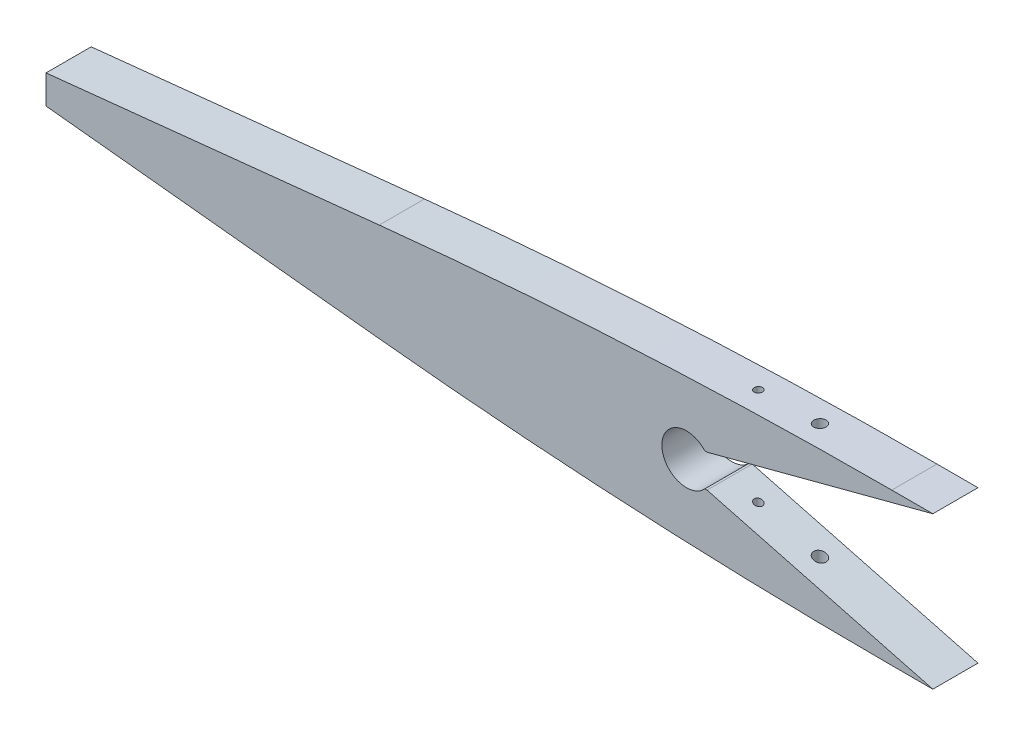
from build123d import *

# Parameters (mm, degrees)
EXTRUDE1_DEPTH          = 5.5
CUT_EXTRUDE1_DEPTH      = 247.755952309
CUT_EXTRUDE1_DEPTH_BACK = 247.755952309
SKETCH2_R               = 1.5
SKETCH2_R_2             = 1


with BuildPart() as part:
    # Sketch1 → Extrude1 (new, symmetric)
    with BuildSketch(Plane.XY):
        with BuildLine():
            Line((-40, 18.5), (-30, 18.5))
            Line((-30, 18.5), (-85, 4))
            Line((-85, 4), (-85.527864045, 4))
            ThreePointArc((-85.527864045, 4), (-96, 0), (-85.527864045, -4))
            Line((-85.527864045, -4), (-85, -4))
            Line((-85, -4), (-30, -18.5))
            Line((-30, -18.5), (-40, -18.5))
            ThreePointArc((-40, -18.5), (-102.498734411, -16.871356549), (-164.827821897, -11.989846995))
            Line((-164.827821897, -11.989846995), (-246, -3.5))
            Line((-246, -3.5), (-246, 3.5))
            Line((-246, 3.5), (-164.827821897, 11.989846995))
            ThreePointArc((-164.827821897, 11.989846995), (-102.498734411, 16.871356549), (-40, 18.5))
        make_face()
    extrude(amount=EXTRUDE1_DEPTH, both=True)

    # Sketch2 → Cut-Extrude1 (cut, two sides: drawn at the far end of the back side and taken through both)
    with BuildSketch(Plane(origin=(0, 0, 0), x_dir=(1, 0, 0), z_dir=(0, 1, 0)).offset(-CUT_EXTRUDE1_DEPTH_BACK)):
        with Locations(Location((-63, 0, 0), (0, 0, 270))):
            Circle(SKETCH2_R)
        with Locations(Location((-78, 0, 0), (0, 0, 270))):
            Circle(SKETCH2_R_2)
    extrude(amount=CUT_EXTRUDE1_DEPTH + CUT_EXTRUDE1_DEPTH_BACK, mode=Mode.SUBTRACT)


solid = part.part
